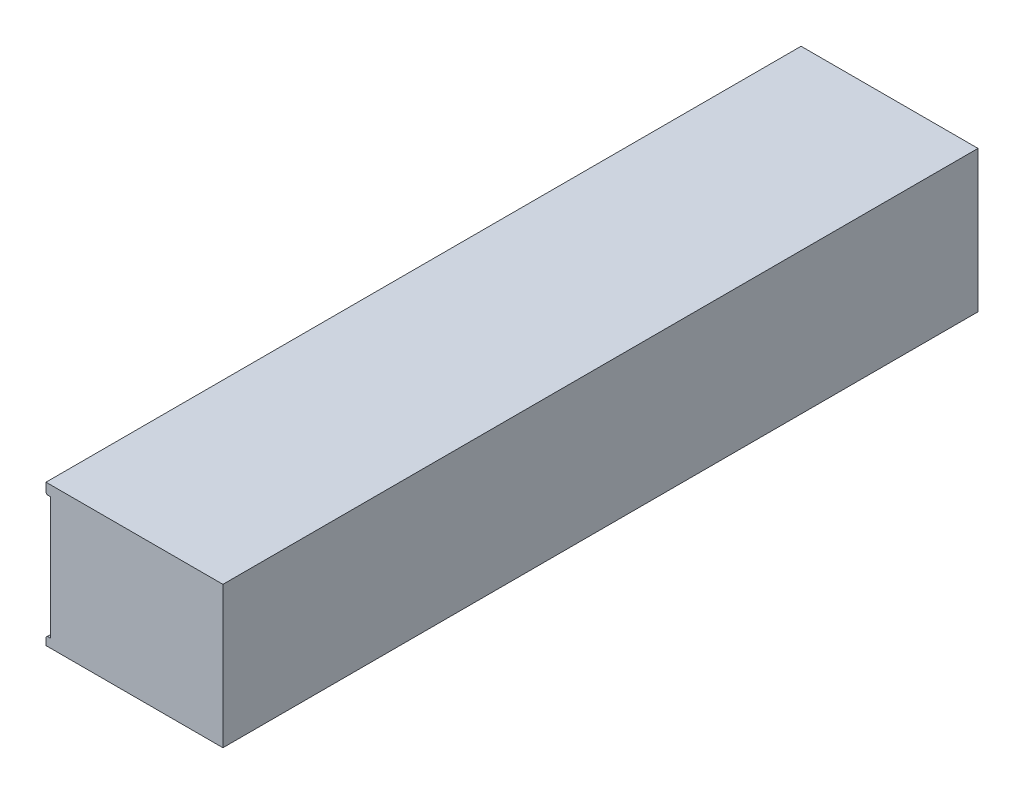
from build123d import *

# Parameters (mm, degrees)
EXTRUDE1_DEPTH                   = 111.1123
F_10_32_TAPPED_HOLE1_D           = 4.0386
F_10_32_TAPPED_HOLE1_DEPTH       = 9.99744
F_10_32_TAPPED_HOLE1_CBORE_D     = 4.826
F_10_32_TAPPED_HOLE1_CBORE_DEPTH = 7.62
F_10_32_TAPPED_HOLE1_TIP         = 1.213317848
CHAMFER1_SIZE                    = 0.381


with BuildPart() as part:
    # Sketch1 → Extrude1 (new, symmetric)
    with BuildSketch(Plane.XY):
        Polygon((50.673, 0), (50.673, -41.656), (-1.397, -41.656), (-1.397, -39.116), (0, -39.116), (0, -3.048), (-1.397, -3.048), (-1.397, 0), align=None)
    extrude(amount=EXTRUDE1_DEPTH, both=True)

    # 10-32 Tapped Hole1
    with Locations(Plane(origin=(0, -6.35, -106.2482), x_dir=(0, 0, -1), z_dir=(-1, 0, 0))):
        with Locations((0, 0), (-212.4964, 0), (-111.125, 0), (-101.3714, 0), (0, 29.464), (-101.3714, 29.464), (-111.125, 29.464), (-212.4964, 29.464), (-45.8216, 0), (-55.5752, 0), (-55.5752, 29.464), (-45.8216, 29.464), (-156.9212, 0), (-166.6748, 0), (-166.6748, 29.464), (-156.9212, 29.464)):
            CounterBoreHole(F_10_32_TAPPED_HOLE1_D / 2, F_10_32_TAPPED_HOLE1_CBORE_D / 2, F_10_32_TAPPED_HOLE1_CBORE_DEPTH, depth=F_10_32_TAPPED_HOLE1_DEPTH)
            with Locations((0, 0, -(F_10_32_TAPPED_HOLE1_DEPTH + F_10_32_TAPPED_HOLE1_TIP / 2))):  # 118° drill point
                Cone(0, F_10_32_TAPPED_HOLE1_D / 2, F_10_32_TAPPED_HOLE1_TIP, mode=Mode.SUBTRACT)

    # Chamfer1
    chamfer1_edges = [part.edges().sort_by_distance(p)[0] for p in [
        (-1.397, -39.116, 0),
        (-1.397, -3.048, 0),
    ]]
    chamfer(chamfer1_edges, length=CHAMFER1_SIZE)


solid = part.part
